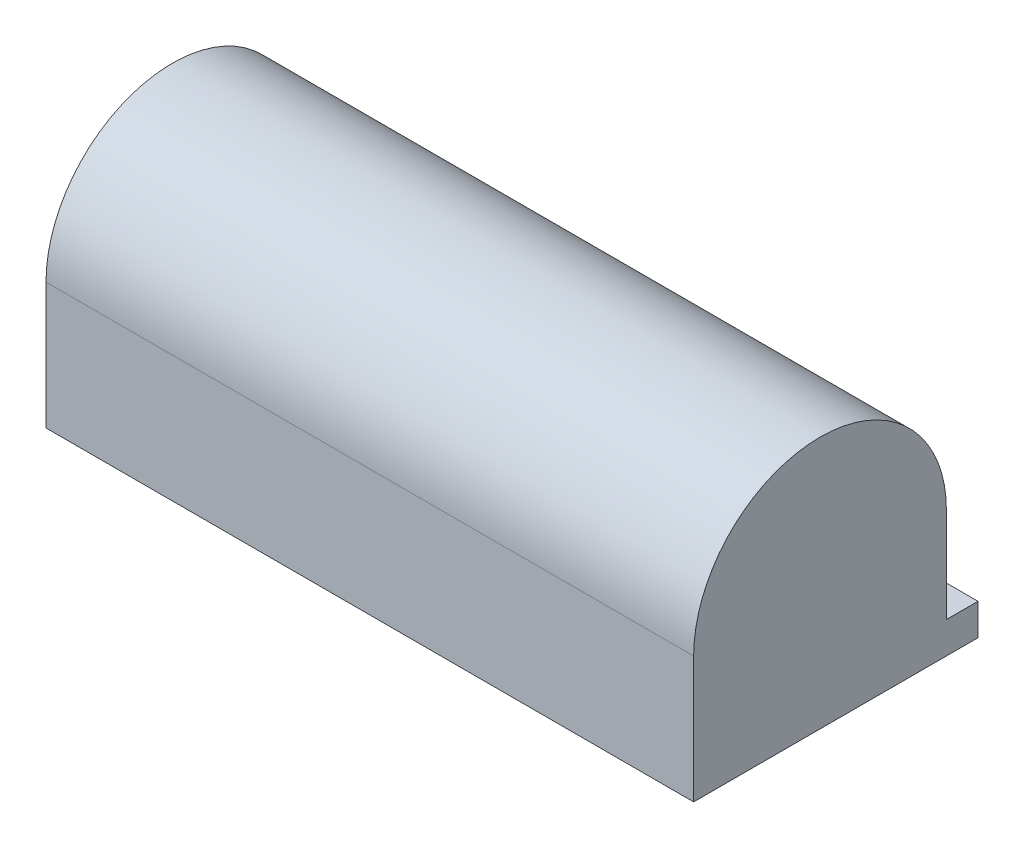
ISO-10303-21;
HEADER;
FILE_DESCRIPTION(('STEP AP214'),'2;1');
FILE_NAME('part.step','',(''),(''),'','','');
FILE_SCHEMA(('AUTOMOTIVE_DESIGN { 1 0 10303 214 1 1 1 1 }'));
ENDSEC;
DATA;
#1=APPLICATION_CONTEXT('core data for automotive mechanical design processes');
#2=APPLICATION_PROTOCOL_DEFINITION('international standard','automotive_design',2000,#1);
#3=PRODUCT_CONTEXT('',#1,'mechanical');
#4=PRODUCT('Part','Part','',(#3));
#5=PRODUCT_RELATED_PRODUCT_CATEGORY('part','',(#4));
#6=PRODUCT_DEFINITION_FORMATION('','',#4);
#7=PRODUCT_DEFINITION_CONTEXT('part definition',#1,'design');
#8=PRODUCT_DEFINITION('design','',#6,#7);
#9=PRODUCT_DEFINITION_SHAPE('','',#8);
#10=(LENGTH_UNIT() NAMED_UNIT(*) SI_UNIT(.MILLI.,.METRE.));
#11=(NAMED_UNIT(*) PLANE_ANGLE_UNIT() SI_UNIT($,.RADIAN.));
#12=(NAMED_UNIT(*) SI_UNIT($,.STERADIAN.) SOLID_ANGLE_UNIT());
#13=UNCERTAINTY_MEASURE_WITH_UNIT(LENGTH_MEASURE(1.E-05),#10,'distance_accuracy_value','');
#14=(GEOMETRIC_REPRESENTATION_CONTEXT(3) GLOBAL_UNCERTAINTY_ASSIGNED_CONTEXT((#13)) GLOBAL_UNIT_ASSIGNED_CONTEXT((#10,
#11,#12)) REPRESENTATION_CONTEXT('',''));
#15=CARTESIAN_POINT('',(0.,0.,0.));
#16=DIRECTION('',(0.,0.,1.));
#17=DIRECTION('',(1.,0.,0.));
#18=AXIS2_PLACEMENT_3D('',#15,#16,#17);
#19=CARTESIAN_POINT('',(0.,2.54,-34.5045662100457));
#20=DIRECTION('',(0.,0.,1.));
#21=DIRECTION('',(1.,0.,0.));
#22=AXIS2_PLACEMENT_3D('',#19,#20,#21);
#23=PLANE('',#22);
#24=DIRECTION('',(0.,1.,0.));
#25=VECTOR('',#24,1.);
#26=CARTESIAN_POINT('',(-17.78,0.,-34.5045662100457));
#27=LINE('',#26,#25);
#28=CARTESIAN_POINT('',(-17.78,2.54,-34.5045662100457));
#29=VERTEX_POINT('',#28);
#30=CARTESIAN_POINT('',(-17.78,5.08,-34.5045662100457));
#31=VERTEX_POINT('',#30);
#32=EDGE_CURVE('E185',#29,#31,#27,.T.);
#33=ORIENTED_EDGE('',*,*,#32,.F.);
#34=DIRECTION('',(-1.,0.,0.));
#35=VECTOR('',#34,1.);
#36=CARTESIAN_POINT('',(0.,2.54,-34.5045662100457));
#37=LINE('',#36,#35);
#38=CARTESIAN_POINT('',(-69.85,2.54,-34.5045662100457));
#39=VERTEX_POINT('',#38);
#40=EDGE_CURVE('E139',#29,#39,#37,.T.);
#41=ORIENTED_EDGE('',*,*,#40,.T.);
#42=DIRECTION('',(0.,-1.,0.));
#43=VECTOR('',#42,1.);
#44=CARTESIAN_POINT('',(-69.85,5.08,-34.5045662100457));
#45=LINE('',#44,#43);
#46=CARTESIAN_POINT('',(-69.85,5.08,-34.5045662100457));
#47=VERTEX_POINT('',#46);
#48=EDGE_CURVE('E187',#47,#39,#45,.T.);
#49=ORIENTED_EDGE('',*,*,#48,.F.);
#50=DIRECTION('',(-1.,0.,0.));
#51=VECTOR('',#50,1.);
#52=CARTESIAN_POINT('',(-17.78,5.08,-34.5045662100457));
#53=LINE('',#52,#51);
#54=EDGE_CURVE('E193',#31,#47,#53,.T.);
#55=ORIENTED_EDGE('',*,*,#54,.F.);
#56=EDGE_LOOP('',(#33,#41,#49,#55));
#57=FACE_BOUND('',#56,.T.);
#58=ADVANCED_FACE('F77',(#57),#23,.F.);
#59=CARTESIAN_POINT('',(-69.85,22.86,-11.6445662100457));
#60=DIRECTION('',(1.,0.,0.));
#61=DIRECTION('',(0.,0.,-1.));
#62=AXIS2_PLACEMENT_3D('',#59,#60,#61);
#63=PLANE('',#62);
#64=DIRECTION('',(0.,0.,1.));
#65=VECTOR('',#64,1.);
#66=CARTESIAN_POINT('',(-69.85,2.54,-11.6445662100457));
#67=LINE('',#66,#65);
#68=CARTESIAN_POINT('',(-69.85,2.54,-11.6445662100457));
#69=VERTEX_POINT('',#68);
#70=EDGE_CURVE('E175',#39,#69,#67,.T.);
#71=ORIENTED_EDGE('',*,*,#70,.T.);
#72=DIRECTION('',(0.,-1.,0.));
#73=VECTOR('',#72,1.);
#74=CARTESIAN_POINT('',(-69.85,22.86,-11.6445662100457));
#75=LINE('',#74,#73);
#76=CARTESIAN_POINT('',(-69.85,12.7,-11.6445662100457));
#77=VERTEX_POINT('',#76);
#78=EDGE_CURVE('E152',#77,#69,#75,.T.);
#79=ORIENTED_EDGE('',*,*,#78,.F.);
#80=CARTESIAN_POINT('',(-69.85,12.7,-21.8045662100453));
#81=DIRECTION('',(1.,0.,0.));
#82=DIRECTION('',(0.,0.,-1.));
#83=AXIS2_PLACEMENT_3D('',#80,#81,#82);
#84=CIRCLE('',#83,10.16);
#85=CARTESIAN_POINT('',(-69.85,12.7,-31.9645662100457));
#86=VERTEX_POINT('',#85);
#87=EDGE_CURVE('E168',#86,#77,#84,.T.);
#88=ORIENTED_EDGE('',*,*,#87,.F.);
#89=DIRECTION('',(0.,-1.,0.));
#90=VECTOR('',#89,1.);
#91=CARTESIAN_POINT('',(-69.85,22.86,-31.9645662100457));
#92=LINE('',#91,#90);
#93=CARTESIAN_POINT('',(-69.85,5.08,-31.9645662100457));
#94=VERTEX_POINT('',#93);
#95=EDGE_CURVE('E155',#86,#94,#92,.T.);
#96=ORIENTED_EDGE('',*,*,#95,.T.);
#97=DIRECTION('',(0.,0.,1.));
#98=VECTOR('',#97,1.);
#99=CARTESIAN_POINT('',(-69.85,5.08,-31.9645662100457));
#100=LINE('',#99,#98);
#101=EDGE_CURVE('E191',#47,#94,#100,.T.);
#102=ORIENTED_EDGE('',*,*,#101,.F.);
#103=ORIENTED_EDGE('',*,*,#48,.T.);
#104=EDGE_LOOP('',(#71,#79,#88,#96,#102,#103));
#105=FACE_BOUND('',#104,.T.);
#106=CARTESIAN_POINT('',(-69.85,12.7,-21.8045662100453));
#107=DIRECTION('',(1.,0.,0.));
#108=DIRECTION('',(0.,0.,-1.));
#109=AXIS2_PLACEMENT_3D('',#106,#107,#108);
#110=CIRCLE('',#109,4.82599999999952);
#111=CARTESIAN_POINT('',(-69.85,12.7,-26.6305662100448));
#112=VERTEX_POINT('',#111);
#113=EDGE_CURVE('E179',#112,#112,#110,.T.);
#114=ORIENTED_EDGE('',*,*,#113,.T.);
#115=EDGE_LOOP('',(#114));
#116=FACE_BOUND('',#115,.T.);
#117=ADVANCED_FACE('F170',(#105,#116),#63,.F.);
#118=CARTESIAN_POINT('',(-63.5,22.86,-31.9645662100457));
#119=DIRECTION('',(0.,0.,1.));
#120=DIRECTION('',(1.,0.,0.));
#121=AXIS2_PLACEMENT_3D('',#118,#119,#120);
#122=PLANE('',#121);
#123=DIRECTION('',(0.,-1.,0.));
#124=VECTOR('',#123,1.);
#125=CARTESIAN_POINT('',(-17.78,22.86,-31.9645662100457));
#126=LINE('',#125,#124);
#127=CARTESIAN_POINT('',(-17.78,12.7,-31.9645662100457));
#128=VERTEX_POINT('',#127);
#129=CARTESIAN_POINT('',(-17.78,5.08,-31.9645662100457));
#130=VERTEX_POINT('',#129);
#131=EDGE_CURVE('E141',#128,#130,#126,.T.);
#132=ORIENTED_EDGE('',*,*,#131,.T.);
#133=DIRECTION('',(1.,0.,0.));
#134=VECTOR('',#133,1.);
#135=CARTESIAN_POINT('',(-17.78,5.08,-31.9645662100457));
#136=LINE('',#135,#134);
#137=EDGE_CURVE('E189',#94,#130,#136,.T.);
#138=ORIENTED_EDGE('',*,*,#137,.F.);
#139=ORIENTED_EDGE('',*,*,#95,.F.);
#140=DIRECTION('',(-1.,0.,0.));
#141=VECTOR('',#140,1.);
#142=CARTESIAN_POINT('',(-17.78,12.7,-31.9645662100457));
#143=LINE('',#142,#141);
#144=EDGE_CURVE('E147',#86,#128,#143,.F.);
#145=ORIENTED_EDGE('',*,*,#144,.T.);
#146=EDGE_LOOP('',(#132,#138,#139,#145));
#147=FACE_BOUND('',#146,.T.);
#148=ADVANCED_FACE('F206',(#147),#122,.F.);
#149=CARTESIAN_POINT('',(-63.5,22.86,-11.6445662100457));
#150=DIRECTION('',(0.,0.,-1.));
#151=DIRECTION('',(-1.,0.,0.));
#152=AXIS2_PLACEMENT_3D('',#149,#150,#151);
#153=PLANE('',#152);
#154=DIRECTION('',(1.,0.,0.));
#155=VECTOR('',#154,1.);
#156=CARTESIAN_POINT('',(-63.5,12.7,-11.6445662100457));
#157=LINE('',#156,#155);
#158=CARTESIAN_POINT('',(-17.78,12.7,-11.6445662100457));
#159=VERTEX_POINT('',#158);
#160=EDGE_CURVE('E12',#159,#77,#157,.F.);
#161=ORIENTED_EDGE('',*,*,#160,.T.);
#162=ORIENTED_EDGE('',*,*,#78,.T.);
#163=DIRECTION('',(1.,0.,0.));
#164=VECTOR('',#163,1.);
#165=CARTESIAN_POINT('',(-63.5,2.54,-11.6445662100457));
#166=LINE('',#165,#164);
#167=CARTESIAN_POINT('',(-17.78,2.54,-11.6445662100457));
#168=VERTEX_POINT('',#167);
#169=EDGE_CURVE('E136',#69,#168,#166,.T.);
#170=ORIENTED_EDGE('',*,*,#169,.T.);
#171=DIRECTION('',(0.,-1.,0.));
#172=VECTOR('',#171,1.);
#173=CARTESIAN_POINT('',(-17.78,22.86,-11.6445662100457));
#174=LINE('',#173,#172);
#175=EDGE_CURVE('E143',#159,#168,#174,.T.);
#176=ORIENTED_EDGE('',*,*,#175,.F.);
#177=EDGE_LOOP('',(#161,#162,#170,#176));
#178=FACE_BOUND('',#177,.T.);
#179=ADVANCED_FACE('F150',(#178),#153,.F.);
#180=CARTESIAN_POINT('',(-17.78,22.86,-31.9645662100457));
#181=DIRECTION('',(-1.,0.,0.));
#182=DIRECTION('',(0.,0.,1.));
#183=AXIS2_PLACEMENT_3D('',#180,#181,#182);
#184=PLANE('',#183);
#185=DIRECTION('',(0.,0.,-1.));
#186=VECTOR('',#185,1.);
#187=CARTESIAN_POINT('',(-17.78,2.54,-31.9645662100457));
#188=LINE('',#187,#186);
#189=EDGE_CURVE('E93',#168,#29,#188,.T.);
#190=ORIENTED_EDGE('',*,*,#189,.T.);
#191=ORIENTED_EDGE('',*,*,#32,.T.);
#192=DIRECTION('',(0.,0.,-1.));
#193=VECTOR('',#192,1.);
#194=CARTESIAN_POINT('',(-17.78,5.08,-31.9645662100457));
#195=LINE('',#194,#193);
#196=EDGE_CURVE('E195',#130,#31,#195,.T.);
#197=ORIENTED_EDGE('',*,*,#196,.F.);
#198=ORIENTED_EDGE('',*,*,#131,.F.);
#199=CARTESIAN_POINT('',(-17.78,12.7,-21.8045662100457));
#200=DIRECTION('',(-1.,0.,0.));
#201=DIRECTION('',(0.,0.,1.));
#202=AXIS2_PLACEMENT_3D('',#199,#200,#201);
#203=CIRCLE('',#202,10.16);
#204=CARTESIAN_POINT('',(-17.78,22.86,-21.8045662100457));
#205=VERTEX_POINT('',#204);
#206=EDGE_CURVE('E86',#128,#205,#203,.F.);
#207=ORIENTED_EDGE('',*,*,#206,.T.);
#208=CARTESIAN_POINT('',(-17.78,12.7,-21.8045662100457));
#209=DIRECTION('',(-1.,0.,0.));
#210=DIRECTION('',(0.,0.,1.));
#211=AXIS2_PLACEMENT_3D('',#208,#209,#210);
#212=CIRCLE('',#211,10.16);
#213=EDGE_CURVE('E99',#205,#159,#212,.F.);
#214=ORIENTED_EDGE('',*,*,#213,.T.);
#215=ORIENTED_EDGE('',*,*,#175,.T.);
#216=EDGE_LOOP('',(#190,#191,#197,#198,#207,#214,#215));
#217=FACE_BOUND('',#216,.T.);
#218=ADVANCED_FACE('F144',(#217),#184,.F.);
#219=CARTESIAN_POINT('',(0.,12.7,-21.8045662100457));
#220=DIRECTION('',(-1.,0.,0.));
#221=DIRECTION('',(0.,0.,1.));
#222=AXIS2_PLACEMENT_3D('',#219,#220,#221);
#223=CYLINDRICAL_SURFACE('',#222,10.16);
#224=ORIENTED_EDGE('',*,*,#160,.F.);
#225=ORIENTED_EDGE('',*,*,#213,.F.);
#226=DIRECTION('',(1.,0.,0.));
#227=VECTOR('',#226,1.);
#228=CARTESIAN_POINT('',(-17.78,22.86,-21.8045662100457));
#229=LINE('',#228,#227);
#230=CARTESIAN_POINT('',(-63.5,22.86,-21.8045662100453));
#231=VERTEX_POINT('',#230);
#232=EDGE_CURVE('E81',#231,#205,#229,.T.);
#233=ORIENTED_EDGE('',*,*,#232,.F.);
#234=ORIENTED_EDGE('',*,*,#232,.T.);
#235=ORIENTED_EDGE('',*,*,#206,.F.);
#236=ORIENTED_EDGE('',*,*,#144,.F.);
#237=ORIENTED_EDGE('',*,*,#87,.T.);
#238=EDGE_LOOP('',(#224,#225,#233,#234,#235,#236,#237));
#239=FACE_BOUND('',#238,.T.);
#240=ADVANCED_FACE('F79',(#239),#223,.T.);
#241=CARTESIAN_POINT('',(-63.5,12.7,-21.8045662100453));
#242=DIRECTION('',(-1.,0.,0.));
#243=DIRECTION('',(0.,0.,1.));
#244=AXIS2_PLACEMENT_3D('',#241,#242,#243);
#245=CYLINDRICAL_SURFACE('',#244,4.82599999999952);
#246=CARTESIAN_POINT('',(-63.5,12.7,-21.8045662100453));
#247=DIRECTION('',(-1.,0.,0.));
#248=DIRECTION('',(0.,0.,1.));
#249=AXIS2_PLACEMENT_3D('',#246,#247,#248);
#250=CIRCLE('',#249,4.82599999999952);
#251=CARTESIAN_POINT('',(-63.5,12.7,-16.9785662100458));
#252=VERTEX_POINT('',#251);
#253=EDGE_CURVE('E182',#252,#252,#250,.T.);
#254=ORIENTED_EDGE('',*,*,#253,.F.);
#255=EDGE_LOOP('',(#254));
#256=FACE_BOUND('',#255,.T.);
#257=ORIENTED_EDGE('',*,*,#113,.F.);
#258=EDGE_LOOP('',(#257));
#259=FACE_BOUND('',#258,.T.);
#260=ADVANCED_FACE('F223',(#256,#259),#245,.F.);
#261=CARTESIAN_POINT('',(-63.5,0.,0.));
#262=DIRECTION('',(-1.,0.,0.));
#263=DIRECTION('',(0.,0.,1.));
#264=AXIS2_PLACEMENT_3D('',#261,#262,#263);
#265=PLANE('',#264);
#266=ORIENTED_EDGE('',*,*,#253,.T.);
#267=EDGE_LOOP('',(#266));
#268=FACE_BOUND('',#267,.T.);
#269=ADVANCED_FACE('F227',(#268),#265,.T.);
#270=CARTESIAN_POINT('',(0.,5.08,0.));
#271=DIRECTION('',(0.,1.,0.));
#272=DIRECTION('',(0.,0.,1.));
#273=AXIS2_PLACEMENT_3D('',#270,#271,#272);
#274=PLANE('',#273);
#275=ORIENTED_EDGE('',*,*,#196,.T.);
#276=ORIENTED_EDGE('',*,*,#54,.T.);
#277=ORIENTED_EDGE('',*,*,#101,.T.);
#278=ORIENTED_EDGE('',*,*,#137,.T.);
#279=EDGE_LOOP('',(#275,#276,#277,#278));
#280=FACE_BOUND('',#279,.T.);
#281=ADVANCED_FACE('F204',(#280),#274,.T.);
#282=CARTESIAN_POINT('',(0.,2.54,0.));
#283=DIRECTION('',(0.,1.,0.));
#284=DIRECTION('',(0.,0.,1.));
#285=AXIS2_PLACEMENT_3D('',#282,#283,#284);
#286=PLANE('',#285);
#287=ORIENTED_EDGE('',*,*,#40,.F.);
#288=ORIENTED_EDGE('',*,*,#189,.F.);
#289=ORIENTED_EDGE('',*,*,#169,.F.);
#290=ORIENTED_EDGE('',*,*,#70,.F.);
#291=EDGE_LOOP('',(#287,#288,#289,#290));
#292=FACE_BOUND('',#291,.T.);
#293=ADVANCED_FACE('F134',(#292),#286,.F.);
#294=CLOSED_SHELL('',(#58,#117,#148,#179,#218,#240,#260,#269,#281,#293));
#295=MANIFOLD_SOLID_BREP('B2',#294);
#296=ADVANCED_BREP_SHAPE_REPRESENTATION('',(#18,#295),#14);
#297=SHAPE_DEFINITION_REPRESENTATION(#9,#296);
ENDSEC;
END-ISO-10303-21;
